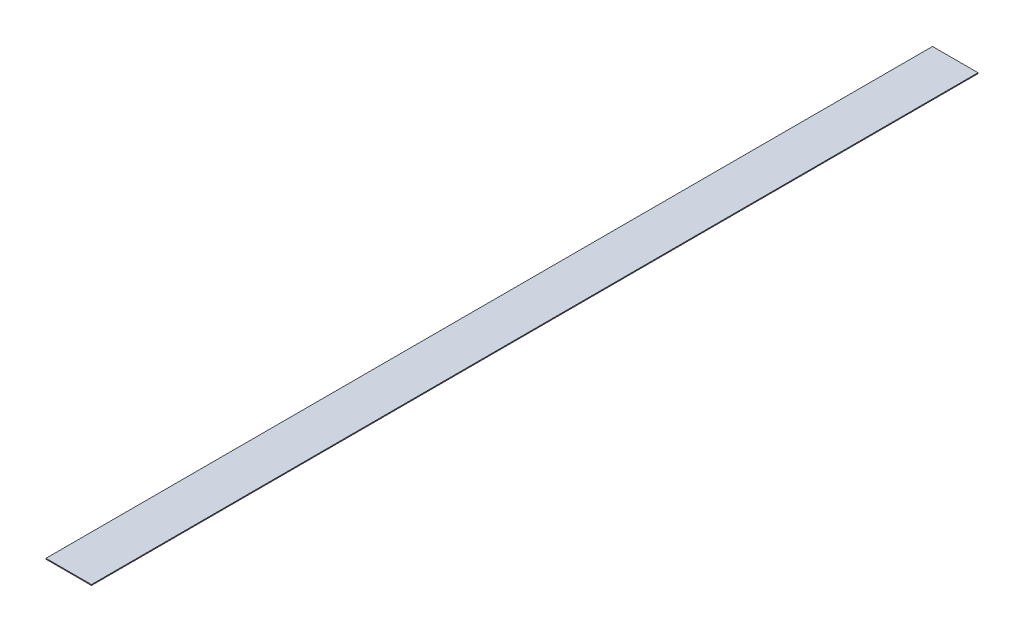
from build123d import *

# Parameters (mm, degrees)
SKETCH1_W           = 78
SKETCH1_H           = 1520
BOSS_EXTRUDE1_DEPTH = 1.5


with BuildPart() as part:
    # Sketch1 → Boss-Extrude1 (new body)
    with BuildSketch(Plane(origin=(0, 0, 0), x_dir=(1, 0, 0), z_dir=(0, 1, 0))):
        with Locations((39, 760)):
            Rectangle(SKETCH1_W, SKETCH1_H)
    extrude(amount=BOSS_EXTRUDE1_DEPTH)


solid = part.part
